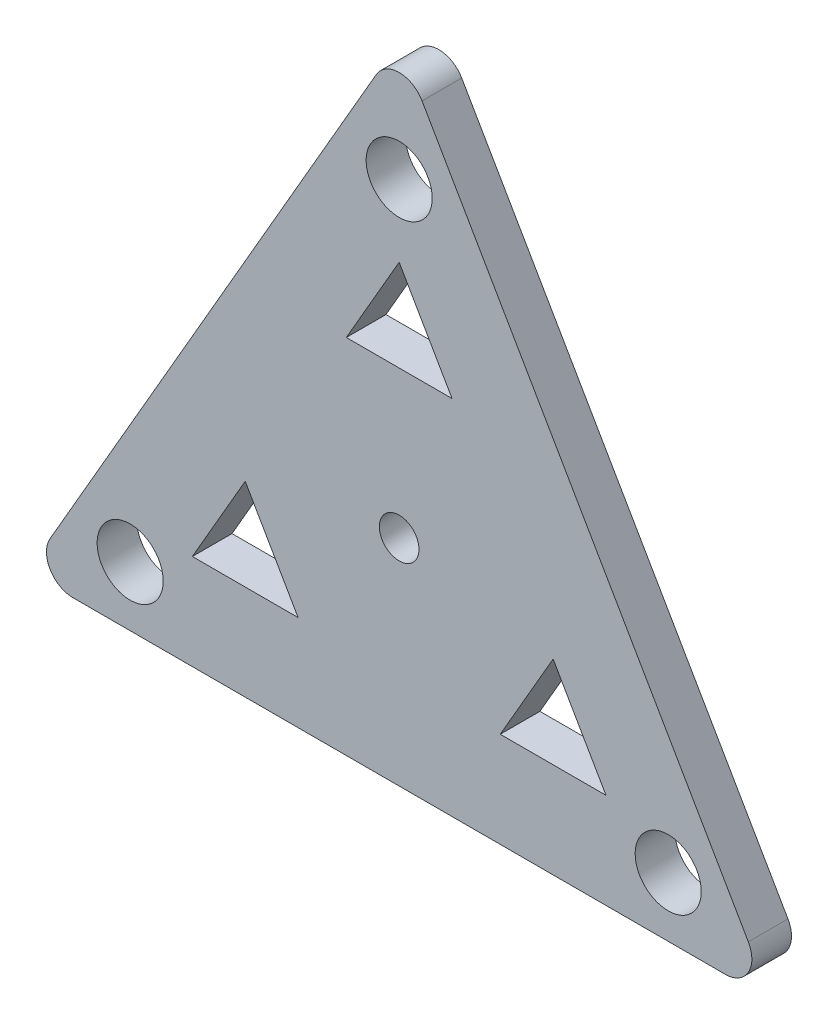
from build123d import *

# Parameters (mm, degrees)
EXTRUDE_1_DEPTH     = 3
FILLET_1_R          = 2
SKETCH_2_R          = 2.5
CUT_EXTRUDE_1_DEPTH = 3
CUT_EXTRUDE_3_DEPTH = 3
SKETCH_4_R          = 1.5
CUT_EXTRUDE_4_DEPTH = 10


with BuildPart() as part:
    # Sketch 1 → Extrude 1 (new body)
    with BuildSketch(Plane.XY):
        Polygon((0, 32.5), (-28.145825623, -16.25), (28.145825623, -16.25), align=None)
    extrude(amount=EXTRUDE_1_DEPTH)

    # Fillet 1
    fillet_1_edges = [part.edges().sort_by_distance(p)[0] for p in [
        (28.145825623, -16.25, 1.5),
        (-28.145825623, -16.25, 1.5),
        (0, 32.5, 1.5),
    ]]
    fillet(fillet_1_edges, radius=FILLET_1_R)

    # Sketch 2 → Cut-Extrude 1 (cut)
    with BuildSketch(Plane.XY.offset(3)):
        with Locations((0, 23.5)):
            Circle(SKETCH_2_R)
        with Locations(Location((-20.351596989, -11.75, 0), (0, 0, 180))):
            Circle(SKETCH_2_R)
        with Locations(Location((20.351596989, -11.75, 0), (0, 0, 180))):
            Circle(SKETCH_2_R)
    extrude(amount=-CUT_EXTRUDE_1_DEPTH, mode=Mode.SUBTRACT)

    # Sketch 3 → Cut-Extrude 3 (cut)
    with BuildSketch(Plane.XY.offset(3)):
        Polygon((0, 18.067246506), (-4, 11.139043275), (4, 11.139043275), align=None)
        Polygon((-11.64669445, -2.105420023), (-7.64669445, -9.033623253), (-15.64669445, -9.033623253), align=None)
        Polygon((7.64669445, -9.033623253), (11.64669445, -2.105420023), (15.64669445, -9.033623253), align=None)
    extrude(amount=-CUT_EXTRUDE_3_DEPTH, mode=Mode.SUBTRACT)

    # Sketch 4 → Cut-Extrude 4 (cut)
    with BuildSketch(Plane.XY.offset(3)):
        Circle(SKETCH_4_R)
    extrude(amount=-CUT_EXTRUDE_4_DEPTH, mode=Mode.SUBTRACT)


solid = part.part
